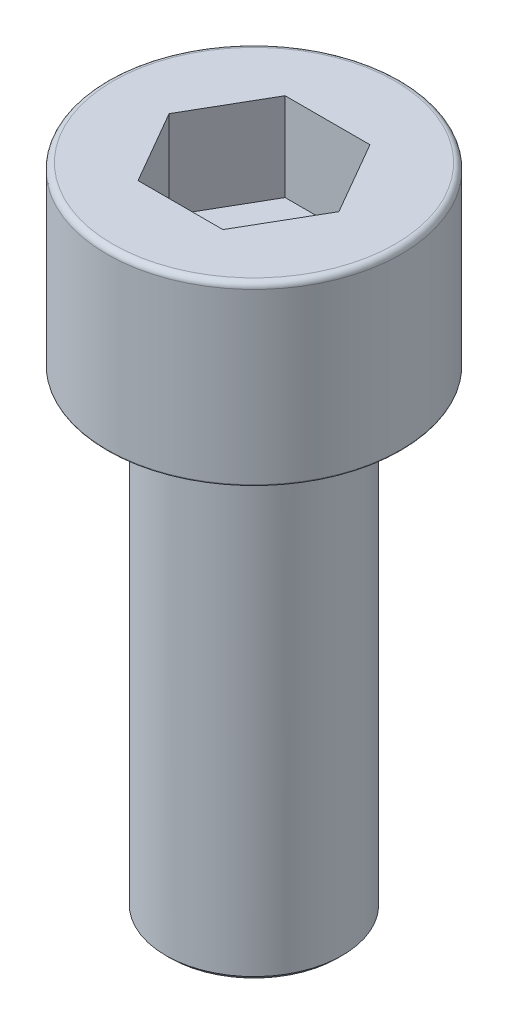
ISO-10303-21;
HEADER;
FILE_DESCRIPTION(('STEP AP214'),'2;1');
FILE_NAME('part.step','',(''),(''),'','','');
FILE_SCHEMA(('AUTOMOTIVE_DESIGN { 1 0 10303 214 1 1 1 1 }'));
ENDSEC;
DATA;
#1=APPLICATION_CONTEXT('core data for automotive mechanical design processes');
#2=APPLICATION_PROTOCOL_DEFINITION('international standard','automotive_design',2000,#1);
#3=PRODUCT_CONTEXT('',#1,'mechanical');
#4=PRODUCT('Part','Part','',(#3));
#5=PRODUCT_RELATED_PRODUCT_CATEGORY('part','',(#4));
#6=PRODUCT_DEFINITION_FORMATION('','',#4);
#7=PRODUCT_DEFINITION_CONTEXT('part definition',#1,'design');
#8=PRODUCT_DEFINITION('design','',#6,#7);
#9=PRODUCT_DEFINITION_SHAPE('','',#8);
#10=(LENGTH_UNIT() NAMED_UNIT(*) SI_UNIT(.MILLI.,.METRE.));
#11=(NAMED_UNIT(*) PLANE_ANGLE_UNIT() SI_UNIT($,.RADIAN.));
#12=(NAMED_UNIT(*) SI_UNIT($,.STERADIAN.) SOLID_ANGLE_UNIT());
#13=UNCERTAINTY_MEASURE_WITH_UNIT(LENGTH_MEASURE(1.E-05),#10,'distance_accuracy_value','');
#14=(GEOMETRIC_REPRESENTATION_CONTEXT(3) GLOBAL_UNCERTAINTY_ASSIGNED_CONTEXT((#13)) GLOBAL_UNIT_ASSIGNED_CONTEXT((#10,
#11,#12)) REPRESENTATION_CONTEXT('',''));
#15=CARTESIAN_POINT('',(0.,0.,0.));
#16=DIRECTION('',(0.,0.,1.));
#17=DIRECTION('',(1.,0.,0.));
#18=AXIS2_PLACEMENT_3D('',#15,#16,#17);
#19=CARTESIAN_POINT('',(1.44337567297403,19.,2.5));
#20=DIRECTION('',(0.,1.,0.));
#21=DIRECTION('',(0.,0.,1.));
#22=AXIS2_PLACEMENT_3D('',#19,#20,#21);
#23=PLANE('',#22);
#24=DIRECTION('',(-0.5,0.,0.866025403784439));
#25=VECTOR('',#24,1.);
#26=CARTESIAN_POINT('',(-1.44337567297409,19.,-2.5));
#27=LINE('',#26,#25);
#28=CARTESIAN_POINT('',(-1.44337567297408,19.,-2.50000000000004));
#29=VERTEX_POINT('',#28);
#30=CARTESIAN_POINT('',(-2.88675134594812,19.,-1.29549550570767E-13));
#31=VERTEX_POINT('',#30);
#32=EDGE_CURVE('E104',#29,#31,#27,.T.);
#33=ORIENTED_EDGE('',*,*,#32,.T.);
#34=DIRECTION('',(0.5,0.,0.866025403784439));
#35=VECTOR('',#34,1.);
#36=CARTESIAN_POINT('',(-2.88675134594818,19.,-1.80411241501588E-13));
#37=LINE('',#36,#35);
#38=CARTESIAN_POINT('',(-1.44337567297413,19.,2.49999999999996));
#39=VERTEX_POINT('',#38);
#40=EDGE_CURVE('E189',#31,#39,#37,.T.);
#41=ORIENTED_EDGE('',*,*,#40,.T.);
#42=DIRECTION('',(1.,0.,0.));
#43=VECTOR('',#42,1.);
#44=CARTESIAN_POINT('',(-1.44337567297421,19.,2.5));
#45=LINE('',#44,#43);
#46=CARTESIAN_POINT('',(1.44337567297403,19.,2.5));
#47=VERTEX_POINT('',#46);
#48=EDGE_CURVE('E184',#39,#47,#45,.T.);
#49=ORIENTED_EDGE('',*,*,#48,.T.);
#50=DIRECTION('',(0.5,0.,-0.866025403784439));
#51=VECTOR('',#50,1.);
#52=CARTESIAN_POINT('',(1.44337567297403,19.,2.5));
#53=LINE('',#52,#51);
#54=CARTESIAN_POINT('',(2.88675134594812,19.,0.));
#55=VERTEX_POINT('',#54);
#56=EDGE_CURVE('E87',#47,#55,#53,.T.);
#57=ORIENTED_EDGE('',*,*,#56,.T.);
#58=DIRECTION('',(-0.5,0.,-0.866025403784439));
#59=VECTOR('',#58,1.);
#60=CARTESIAN_POINT('',(2.88675134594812,19.,0.));
#61=LINE('',#60,#59);
#62=CARTESIAN_POINT('',(1.44337567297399,19.,-2.50000000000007));
#63=VERTEX_POINT('',#62);
#64=EDGE_CURVE('E84',#55,#63,#61,.T.);
#65=ORIENTED_EDGE('',*,*,#64,.T.);
#66=DIRECTION('',(-1.,0.,0.));
#67=VECTOR('',#66,1.);
#68=CARTESIAN_POINT('',(1.44337567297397,19.,-2.50000000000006));
#69=LINE('',#68,#67);
#70=EDGE_CURVE('E81',#63,#29,#69,.T.);
#71=ORIENTED_EDGE('',*,*,#70,.T.);
#72=EDGE_LOOP('',(#33,#41,#49,#57,#65,#71));
#73=FACE_BOUND('',#72,.T.);
#74=ADVANCED_FACE('F17',(#73),#23,.T.);
#75=CARTESIAN_POINT('',(2.88675134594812,19.,0.));
#76=DIRECTION('',(0.866025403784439,0.,-0.5));
#77=DIRECTION('',(-0.5,0.,-0.866025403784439));
#78=AXIS2_PLACEMENT_3D('',#75,#76,#77);
#79=PLANE('',#78);
#80=DIRECTION('',(0.,1.,0.));
#81=VECTOR('',#80,1.);
#82=CARTESIAN_POINT('',(1.44337567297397,19.,-2.50000000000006));
#83=LINE('',#82,#81);
#84=CARTESIAN_POINT('',(1.44337567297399,22.,-2.50000000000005));
#85=VERTEX_POINT('',#84);
#86=EDGE_CURVE('E90',#85,#63,#83,.F.);
#87=ORIENTED_EDGE('',*,*,#86,.T.);
#88=ORIENTED_EDGE('',*,*,#64,.F.);
#89=DIRECTION('',(0.,1.,0.));
#90=VECTOR('',#89,1.);
#91=CARTESIAN_POINT('',(2.88675134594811,19.,0.));
#92=LINE('',#91,#90);
#93=CARTESIAN_POINT('',(2.88675134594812,22.,0.));
#94=VERTEX_POINT('',#93);
#95=EDGE_CURVE('E173',#55,#94,#92,.T.);
#96=ORIENTED_EDGE('',*,*,#95,.T.);
#97=DIRECTION('',(-0.500000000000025,0.,-0.866025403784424));
#98=VECTOR('',#97,1.);
#99=CARTESIAN_POINT('',(2.88675134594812,22.,0.));
#100=LINE('',#99,#98);
#101=EDGE_CURVE('E95',#94,#85,#100,.T.);
#102=ORIENTED_EDGE('',*,*,#101,.T.);
#103=EDGE_LOOP('',(#87,#88,#96,#102));
#104=FACE_BOUND('',#103,.T.);
#105=ADVANCED_FACE('F93',(#104),#79,.F.);
#106=CARTESIAN_POINT('',(1.44337567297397,19.,-2.50000000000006));
#107=DIRECTION('',(0.,0.,-1.));
#108=DIRECTION('',(-1.,0.,0.));
#109=AXIS2_PLACEMENT_3D('',#106,#107,#108);
#110=PLANE('',#109);
#111=DIRECTION('',(0.,1.,0.));
#112=VECTOR('',#111,1.);
#113=CARTESIAN_POINT('',(-1.44337567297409,19.,-2.5));
#114=LINE('',#113,#112);
#115=CARTESIAN_POINT('',(-1.44337567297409,22.,-2.50000000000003));
#116=VERTEX_POINT('',#115);
#117=EDGE_CURVE('E101',#116,#29,#114,.F.);
#118=ORIENTED_EDGE('',*,*,#117,.T.);
#119=ORIENTED_EDGE('',*,*,#70,.F.);
#120=ORIENTED_EDGE('',*,*,#86,.F.);
#121=DIRECTION('',(1.,0.,0.));
#122=VECTOR('',#121,1.);
#123=CARTESIAN_POINT('',(-5.00000000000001,22.,-2.49999999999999));
#124=LINE('',#123,#122);
#125=EDGE_CURVE('E219',#85,#116,#124,.F.);
#126=ORIENTED_EDGE('',*,*,#125,.T.);
#127=EDGE_LOOP('',(#118,#119,#120,#126));
#128=FACE_BOUND('',#127,.T.);
#129=ADVANCED_FACE('F99',(#128),#110,.F.);
#130=CARTESIAN_POINT('',(-1.44337567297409,19.,-2.5));
#131=DIRECTION('',(-0.866025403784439,0.,-0.5));
#132=DIRECTION('',(-0.5,0.,0.866025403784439));
#133=AXIS2_PLACEMENT_3D('',#130,#131,#132);
#134=PLANE('',#133);
#135=DIRECTION('',(0.,1.,0.));
#136=VECTOR('',#135,1.);
#137=CARTESIAN_POINT('',(-2.88675134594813,19.,0.));
#138=LINE('',#137,#136);
#139=CARTESIAN_POINT('',(-2.88675134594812,22.,0.));
#140=VERTEX_POINT('',#139);
#141=EDGE_CURVE('E191',#140,#31,#138,.F.);
#142=ORIENTED_EDGE('',*,*,#141,.T.);
#143=ORIENTED_EDGE('',*,*,#32,.F.);
#144=ORIENTED_EDGE('',*,*,#117,.F.);
#145=DIRECTION('',(-0.500000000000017,0.,0.866025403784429));
#146=VECTOR('',#145,1.);
#147=CARTESIAN_POINT('',(-1.44337567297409,22.,-2.5));
#148=LINE('',#147,#146);
#149=EDGE_CURVE('E198',#116,#140,#148,.T.);
#150=ORIENTED_EDGE('',*,*,#149,.T.);
#151=EDGE_LOOP('',(#142,#143,#144,#150));
#152=FACE_BOUND('',#151,.T.);
#153=ADVANCED_FACE('F196',(#152),#134,.F.);
#154=CARTESIAN_POINT('',(-2.88675134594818,19.,-1.80411241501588E-13));
#155=DIRECTION('',(-0.866025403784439,0.,0.5));
#156=DIRECTION('',(0.5,0.,0.866025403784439));
#157=AXIS2_PLACEMENT_3D('',#154,#155,#156);
#158=PLANE('',#157);
#159=DIRECTION('',(0.,1.,0.));
#160=VECTOR('',#159,1.);
#161=CARTESIAN_POINT('',(-1.44337567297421,19.,2.5));
#162=LINE('',#161,#160);
#163=CARTESIAN_POINT('',(-1.44337567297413,22.,2.49999999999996));
#164=VERTEX_POINT('',#163);
#165=EDGE_CURVE('E186',#164,#39,#162,.F.);
#166=ORIENTED_EDGE('',*,*,#165,.T.);
#167=ORIENTED_EDGE('',*,*,#40,.F.);
#168=ORIENTED_EDGE('',*,*,#141,.F.);
#169=DIRECTION('',(0.499999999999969,0.,0.866025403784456));
#170=VECTOR('',#169,1.);
#171=CARTESIAN_POINT('',(-2.88675134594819,22.,0.));
#172=LINE('',#171,#170);
#173=EDGE_CURVE('E204',#140,#164,#172,.T.);
#174=ORIENTED_EDGE('',*,*,#173,.T.);
#175=EDGE_LOOP('',(#166,#167,#168,#174));
#176=FACE_BOUND('',#175,.T.);
#177=ADVANCED_FACE('F201',(#176),#158,.F.);
#178=CARTESIAN_POINT('',(-1.44337567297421,19.,2.5));
#179=DIRECTION('',(0.,0.,1.));
#180=DIRECTION('',(1.,0.,0.));
#181=AXIS2_PLACEMENT_3D('',#178,#179,#180);
#182=PLANE('',#181);
#183=DIRECTION('',(0.,1.,0.));
#184=VECTOR('',#183,1.);
#185=CARTESIAN_POINT('',(1.44337567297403,19.,2.5));
#186=LINE('',#185,#184);
#187=CARTESIAN_POINT('',(1.44337567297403,22.,2.5));
#188=VERTEX_POINT('',#187);
#189=EDGE_CURVE('E181',#188,#47,#186,.F.);
#190=ORIENTED_EDGE('',*,*,#189,.T.);
#191=ORIENTED_EDGE('',*,*,#48,.F.);
#192=ORIENTED_EDGE('',*,*,#165,.F.);
#193=DIRECTION('',(1.,0.,0.));
#194=VECTOR('',#193,1.);
#195=CARTESIAN_POINT('',(-5.00000000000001,22.,2.5));
#196=LINE('',#195,#194);
#197=EDGE_CURVE('E209',#164,#188,#196,.T.);
#198=ORIENTED_EDGE('',*,*,#197,.T.);
#199=EDGE_LOOP('',(#190,#191,#192,#198));
#200=FACE_BOUND('',#199,.T.);
#201=ADVANCED_FACE('F207',(#200),#182,.F.);
#202=CARTESIAN_POINT('',(1.44337567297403,19.,2.5));
#203=DIRECTION('',(0.866025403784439,0.,0.5));
#204=DIRECTION('',(0.5,0.,-0.866025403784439));
#205=AXIS2_PLACEMENT_3D('',#202,#203,#204);
#206=PLANE('',#205);
#207=ORIENTED_EDGE('',*,*,#95,.F.);
#208=ORIENTED_EDGE('',*,*,#56,.F.);
#209=ORIENTED_EDGE('',*,*,#189,.F.);
#210=DIRECTION('',(0.500000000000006,0.,-0.866025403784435));
#211=VECTOR('',#210,1.);
#212=CARTESIAN_POINT('',(1.44337567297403,22.,2.5));
#213=LINE('',#212,#211);
#214=EDGE_CURVE('E214',#188,#94,#213,.T.);
#215=ORIENTED_EDGE('',*,*,#214,.T.);
#216=EDGE_LOOP('',(#207,#208,#209,#215));
#217=FACE_BOUND('',#216,.T.);
#218=ADVANCED_FACE('F213',(#217),#206,.F.);
#219=CARTESIAN_POINT('',(-5.00000000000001,22.,0.));
#220=DIRECTION('',(0.,-1.,0.));
#221=DIRECTION('',(0.,0.,-1.));
#222=AXIS2_PLACEMENT_3D('',#219,#220,#221);
#223=PLANE('',#222);
#224=ORIENTED_EDGE('',*,*,#197,.F.);
#225=ORIENTED_EDGE('',*,*,#173,.F.);
#226=ORIENTED_EDGE('',*,*,#149,.F.);
#227=ORIENTED_EDGE('',*,*,#125,.F.);
#228=ORIENTED_EDGE('',*,*,#101,.F.);
#229=ORIENTED_EDGE('',*,*,#214,.F.);
#230=EDGE_LOOP('',(#224,#225,#226,#227,#228,#229));
#231=FACE_BOUND('',#230,.T.);
#232=CARTESIAN_POINT('',(0.,22.,0.));
#233=DIRECTION('',(0.,-1.,0.));
#234=DIRECTION('',(0.,0.,-1.));
#235=AXIS2_PLACEMENT_3D('',#232,#233,#234);
#236=CIRCLE('',#235,4.8);
#237=CARTESIAN_POINT('',(0.,22.,-4.8));
#238=VERTEX_POINT('',#237);
#239=CARTESIAN_POINT('',(0.,22.,4.8));
#240=VERTEX_POINT('',#239);
#241=EDGE_CURVE('E216',#238,#240,#236,.T.);
#242=ORIENTED_EDGE('',*,*,#241,.F.);
#243=CARTESIAN_POINT('',(0.,22.,0.));
#244=DIRECTION('',(0.,-1.,0.));
#245=DIRECTION('',(0.,0.,1.));
#246=AXIS2_PLACEMENT_3D('',#243,#244,#245);
#247=CIRCLE('',#246,4.8);
#248=EDGE_CURVE('E153',#240,#238,#247,.T.);
#249=ORIENTED_EDGE('',*,*,#248,.F.);
#250=EDGE_LOOP('',(#242,#249));
#251=FACE_BOUND('',#250,.T.);
#252=ADVANCED_FACE('F161',(#231,#251),#223,.F.);
#253=CARTESIAN_POINT('',(0.,21.8,0.));
#254=DIRECTION('',(0.,-1.,0.));
#255=DIRECTION('',(0.,0.,-1.));
#256=AXIS2_PLACEMENT_3D('',#253,#254,#255);
#257=TOROIDAL_SURFACE('',#256,4.8,0.2);
#258=ORIENTED_EDGE('',*,*,#241,.T.);
#259=ORIENTED_EDGE('',*,*,#248,.T.);
#260=EDGE_LOOP('',(#258,#259));
#261=FACE_BOUND('',#260,.T.);
#262=CARTESIAN_POINT('',(0.,21.8,0.));
#263=DIRECTION('',(0.,-1.,0.));
#264=DIRECTION('',(0.,0.,-1.));
#265=AXIS2_PLACEMENT_3D('',#262,#263,#264);
#266=CIRCLE('',#265,5.);
#267=CARTESIAN_POINT('',(0.,21.8,-5.));
#268=VERTEX_POINT('',#267);
#269=EDGE_CURVE('E150',#268,#268,#266,.T.);
#270=ORIENTED_EDGE('',*,*,#269,.F.);
#271=EDGE_LOOP('',(#270));
#272=FACE_BOUND('',#271,.T.);
#273=ADVANCED_FACE('F157',(#261,#272),#257,.T.);
#274=CARTESIAN_POINT('',(0.,0.,0.));
#275=DIRECTION('',(0.,-1.,0.));
#276=DIRECTION('',(0.,0.,-1.));
#277=AXIS2_PLACEMENT_3D('',#274,#275,#276);
#278=CYLINDRICAL_SURFACE('',#277,5.);
#279=ORIENTED_EDGE('',*,*,#269,.T.);
#280=EDGE_LOOP('',(#279));
#281=FACE_BOUND('',#280,.T.);
#282=CARTESIAN_POINT('',(0.,16.05,0.));
#283=DIRECTION('',(0.,1.,0.));
#284=DIRECTION('',(0.,0.,1.));
#285=AXIS2_PLACEMENT_3D('',#282,#283,#284);
#286=CIRCLE('',#285,5.);
#287=CARTESIAN_POINT('',(0.,16.05,5.));
#288=VERTEX_POINT('',#287);
#289=EDGE_CURVE('E142',#288,#288,#286,.F.);
#290=ORIENTED_EDGE('',*,*,#289,.F.);
#291=EDGE_LOOP('',(#290));
#292=FACE_BOUND('',#291,.T.);
#293=ADVANCED_FACE('F129',(#281,#292),#278,.T.);
#294=CARTESIAN_POINT('',(0.,16.05,0.));
#295=DIRECTION('',(0.,1.,0.));
#296=DIRECTION('',(0.,0.,1.));
#297=AXIS2_PLACEMENT_3D('',#294,#295,#296);
#298=TOROIDAL_SURFACE('',#297,4.95,0.05);
#299=CARTESIAN_POINT('',(0.,16.,0.));
#300=DIRECTION('',(0.,1.,0.));
#301=DIRECTION('',(0.,0.,1.));
#302=AXIS2_PLACEMENT_3D('',#299,#300,#301);
#303=CIRCLE('',#302,4.95);
#304=CARTESIAN_POINT('',(0.,16.,4.95));
#305=VERTEX_POINT('',#304);
#306=CARTESIAN_POINT('',(0.,16.,-4.95));
#307=VERTEX_POINT('',#306);
#308=EDGE_CURVE('E36',#305,#307,#303,.T.);
#309=ORIENTED_EDGE('',*,*,#308,.T.);
#310=CARTESIAN_POINT('',(0.,16.,0.));
#311=DIRECTION('',(0.,1.,0.));
#312=DIRECTION('',(0.,0.,-1.));
#313=AXIS2_PLACEMENT_3D('',#310,#311,#312);
#314=CIRCLE('',#313,4.95);
#315=EDGE_CURVE('E112',#307,#305,#314,.T.);
#316=ORIENTED_EDGE('',*,*,#315,.T.);
#317=EDGE_LOOP('',(#309,#316));
#318=FACE_BOUND('',#317,.T.);
#319=ORIENTED_EDGE('',*,*,#289,.T.);
#320=EDGE_LOOP('',(#319));
#321=FACE_BOUND('',#320,.T.);
#322=ADVANCED_FACE('F117',(#318,#321),#298,.T.);
#323=CARTESIAN_POINT('',(0.,0.,0.));
#324=DIRECTION('',(0.,1.,0.));
#325=DIRECTION('',(0.,0.,1.));
#326=AXIS2_PLACEMENT_3D('',#323,#324,#325);
#327=PLANE('',#326);
#328=CARTESIAN_POINT('',(0.,0.,0.));
#329=DIRECTION('',(0.,1.,0.));
#330=DIRECTION('',(0.,0.,1.));
#331=AXIS2_PLACEMENT_3D('',#328,#329,#330);
#332=CIRCLE('',#331,2.8500000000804);
#333=CARTESIAN_POINT('',(0.,0.,2.8500000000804));
#334=VERTEX_POINT('',#333);
#335=EDGE_CURVE('E110',#334,#334,#332,.T.);
#336=ORIENTED_EDGE('',*,*,#335,.F.);
#337=EDGE_LOOP('',(#336));
#338=FACE_BOUND('',#337,.T.);
#339=ADVANCED_FACE('F128',(#338),#327,.F.);
#340=CARTESIAN_POINT('',(-3.00000000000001,16.,0.));
#341=DIRECTION('',(0.,1.,0.));
#342=DIRECTION('',(0.,0.,1.));
#343=AXIS2_PLACEMENT_3D('',#340,#341,#342);
#344=PLANE('',#343);
#345=CARTESIAN_POINT('',(0.,16.,0.));
#346=DIRECTION('',(0.,-1.,0.));
#347=DIRECTION('',(0.,0.,-1.));
#348=AXIS2_PLACEMENT_3D('',#345,#346,#347);
#349=CIRCLE('',#348,3.);
#350=CARTESIAN_POINT('',(0.,16.,-3.));
#351=VERTEX_POINT('',#350);
#352=EDGE_CURVE('E28',#351,#351,#349,.T.);
#353=ORIENTED_EDGE('',*,*,#352,.F.);
#354=EDGE_LOOP('',(#353));
#355=FACE_BOUND('',#354,.T.);
#356=ORIENTED_EDGE('',*,*,#308,.F.);
#357=ORIENTED_EDGE('',*,*,#315,.F.);
#358=EDGE_LOOP('',(#356,#357));
#359=FACE_BOUND('',#358,.T.);
#360=ADVANCED_FACE('F259',(#355,#359),#344,.F.);
#361=CARTESIAN_POINT('',(0.,0.15000000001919,0.));
#362=DIRECTION('',(0.,1.,0.));
#363=DIRECTION('',(0.,0.,1.));
#364=AXIS2_PLACEMENT_3D('',#361,#362,#363);
#365=CONICAL_SURFACE('',#364,3.00000000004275,0.78539816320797);
#366=CARTESIAN_POINT('',(0.,0.150000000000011,0.));
#367=DIRECTION('',(0.,-1.,0.));
#368=DIRECTION('',(0.,0.,-1.));
#369=AXIS2_PLACEMENT_3D('',#366,#367,#368);
#370=CIRCLE('',#369,3.);
#371=CARTESIAN_POINT('',(0.,0.150000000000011,-3.));
#372=VERTEX_POINT('',#371);
#373=EDGE_CURVE('E11',#372,#372,#370,.F.);
#374=ORIENTED_EDGE('',*,*,#373,.F.);
#375=EDGE_LOOP('',(#374));
#376=FACE_BOUND('',#375,.T.);
#377=ORIENTED_EDGE('',*,*,#335,.T.);
#378=EDGE_LOOP('',(#377));
#379=FACE_BOUND('',#378,.T.);
#380=ADVANCED_FACE('F253',(#376,#379),#365,.T.);
#381=CARTESIAN_POINT('',(0.,0.,0.));
#382=DIRECTION('',(0.,-1.,0.));
#383=DIRECTION('',(0.,0.,-1.));
#384=AXIS2_PLACEMENT_3D('',#381,#382,#383);
#385=CYLINDRICAL_SURFACE('',#384,3.);
#386=ORIENTED_EDGE('',*,*,#373,.T.);
#387=EDGE_LOOP('',(#386));
#388=FACE_BOUND('',#387,.T.);
#389=ORIENTED_EDGE('',*,*,#352,.T.);
#390=EDGE_LOOP('',(#389));
#391=FACE_BOUND('',#390,.T.);
#392=ADVANCED_FACE('F251',(#388,#391),#385,.T.);
#393=CLOSED_SHELL('',(#74,#105,#129,#153,#177,#201,#218,#252,#273,#293,#322,#339,#360,#380,#392));
#394=MANIFOLD_SOLID_BREP('B1',#393);
#395=ADVANCED_BREP_SHAPE_REPRESENTATION('',(#18,#394),#14);
#396=SHAPE_DEFINITION_REPRESENTATION(#9,#395);
ENDSEC;
END-ISO-10303-21;
